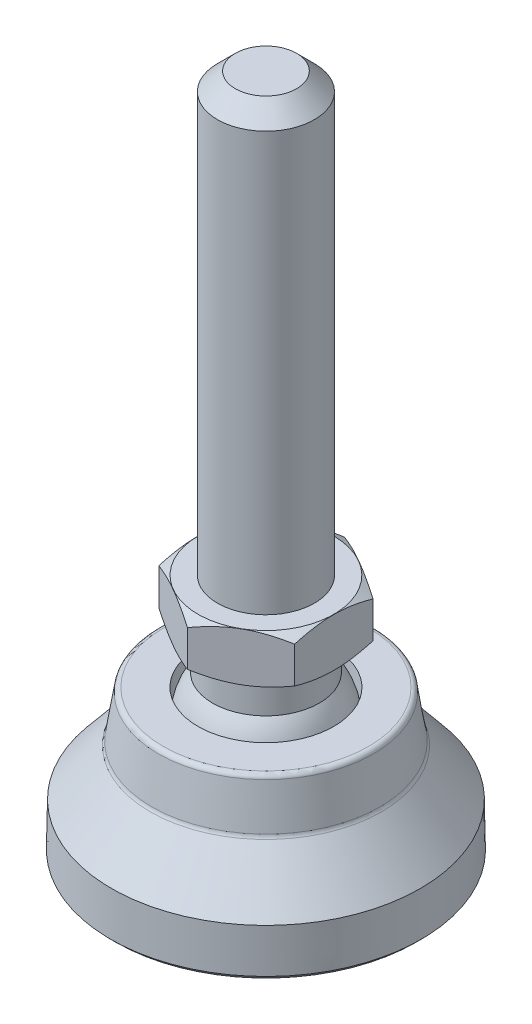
ISO-10303-21;
HEADER;
FILE_DESCRIPTION(('STEP AP214'),'2;1');
FILE_NAME('part.step','',(''),(''),'','','');
FILE_SCHEMA(('AUTOMOTIVE_DESIGN { 1 0 10303 214 1 1 1 1 }'));
ENDSEC;
DATA;
#1=APPLICATION_CONTEXT('core data for automotive mechanical design processes');
#2=APPLICATION_PROTOCOL_DEFINITION('international standard','automotive_design',2000,#1);
#3=PRODUCT_CONTEXT('',#1,'mechanical');
#4=PRODUCT('Part','Part','',(#3));
#5=PRODUCT_RELATED_PRODUCT_CATEGORY('part','',(#4));
#6=PRODUCT_DEFINITION_FORMATION('','',#4);
#7=PRODUCT_DEFINITION_CONTEXT('part definition',#1,'design');
#8=PRODUCT_DEFINITION('design','',#6,#7);
#9=PRODUCT_DEFINITION_SHAPE('','',#8);
#10=(LENGTH_UNIT() NAMED_UNIT(*) SI_UNIT(.MILLI.,.METRE.));
#11=(NAMED_UNIT(*) PLANE_ANGLE_UNIT() SI_UNIT($,.RADIAN.));
#12=(NAMED_UNIT(*) SI_UNIT($,.STERADIAN.) SOLID_ANGLE_UNIT());
#13=UNCERTAINTY_MEASURE_WITH_UNIT(LENGTH_MEASURE(1.E-05),#10,'distance_accuracy_value','');
#14=(GEOMETRIC_REPRESENTATION_CONTEXT(3) GLOBAL_UNCERTAINTY_ASSIGNED_CONTEXT((#13)) GLOBAL_UNIT_ASSIGNED_CONTEXT((#10,
#11,#12)) REPRESENTATION_CONTEXT('',''));
#15=CARTESIAN_POINT('',(0.,0.,0.));
#16=DIRECTION('',(0.,0.,1.));
#17=DIRECTION('',(1.,0.,0.));
#18=AXIS2_PLACEMENT_3D('',#15,#16,#17);
#19=CARTESIAN_POINT('',(0.,69.0800000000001,0.));
#20=DIRECTION('',(0.,-1.,0.));
#21=DIRECTION('',(1.,0.,0.));
#22=AXIS2_PLACEMENT_3D('',#19,#20,#21);
#23=CONICAL_SURFACE('',#22,4.08,0.785398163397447);
#24=CARTESIAN_POINT('',(0.,70.,0.));
#25=DIRECTION('',(0.,1.,0.));
#26=DIRECTION('',(1.,0.,0.));
#27=AXIS2_PLACEMENT_3D('',#24,#25,#26);
#28=CIRCLE('',#27,3.16);
#29=CARTESIAN_POINT('',(-3.16000000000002,70.0000000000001,0.));
#30=VERTEX_POINT('',#29);
#31=EDGE_CURVE('P0_E56',#30,#30,#28,.T.);
#32=ORIENTED_EDGE('',*,*,#31,.F.);
#33=EDGE_LOOP('',(#32));
#34=FACE_BOUND('',#33,.T.);
#35=CARTESIAN_POINT('',(0.,68.16,0.));
#36=DIRECTION('',(0.,1.,0.));
#37=DIRECTION('',(1.,0.,0.));
#38=AXIS2_PLACEMENT_3D('',#35,#36,#37);
#39=CIRCLE('',#38,5.);
#40=CARTESIAN_POINT('',(-5.00000000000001,68.16,0.));
#41=VERTEX_POINT('',#40);
#42=EDGE_CURVE('P0_E13',#41,#41,#39,.T.);
#43=ORIENTED_EDGE('',*,*,#42,.T.);
#44=EDGE_LOOP('',(#43));
#45=FACE_BOUND('',#44,.T.);
#46=ADVANCED_FACE('P0_F44',(#34,#45),#23,.T.);
#47=CARTESIAN_POINT('',(0.,45.58,0.));
#48=DIRECTION('',(0.,-1.,0.));
#49=DIRECTION('',(1.,0.,0.));
#50=AXIS2_PLACEMENT_3D('',#47,#48,#49);
#51=CYLINDRICAL_SURFACE('',#50,5.);
#52=ORIENTED_EDGE('',*,*,#42,.F.);
#53=EDGE_LOOP('',(#52));
#54=FACE_BOUND('',#53,.T.);
#55=CARTESIAN_POINT('',(0.,25.0000000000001,0.));
#56=DIRECTION('',(0.,1.,0.));
#57=DIRECTION('',(1.,0.,0.));
#58=AXIS2_PLACEMENT_3D('',#55,#56,#57);
#59=CIRCLE('',#58,5.);
#60=CARTESIAN_POINT('',(-5.,25.0000000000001,0.));
#61=VERTEX_POINT('',#60);
#62=EDGE_CURVE('P0_E52',#61,#61,#59,.T.);
#63=ORIENTED_EDGE('',*,*,#62,.T.);
#64=EDGE_LOOP('',(#63));
#65=FACE_BOUND('',#64,.T.);
#66=ADVANCED_FACE('P0_F302',(#54,#65),#51,.T.);
#67=CARTESIAN_POINT('',(0.,23.7500000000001,0.));
#68=DIRECTION('',(0.,-1.,0.));
#69=DIRECTION('',(1.,0.,0.));
#70=AXIS2_PLACEMENT_3D('',#67,#68,#69);
#71=CONICAL_SURFACE('',#70,9.1550635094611,1.0471975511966);
#72=CARTESIAN_POINT('',(0.,25.0000000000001,0.));
#73=DIRECTION('',(0.,1.,0.));
#74=DIRECTION('',(1.,0.,0.));
#75=AXIS2_PLACEMENT_3D('',#72,#73,#74);
#76=CIRCLE('',#75,6.99);
#77=CARTESIAN_POINT('',(-6.99,25.,0.));
#78=VERTEX_POINT('',#77);
#79=EDGE_CURVE('P0_E155',#78,#78,#76,.T.);
#80=ORIENTED_EDGE('',*,*,#79,.F.);
#81=EDGE_LOOP('',(#80));
#82=FACE_BOUND('',#81,.T.);
#83=CARTESIAN_POINT('',(-7.00000000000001,24.3690117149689,-4.04145188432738));
#84=CARTESIAN_POINT('',(-7.00000000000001,24.9942264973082,-1.87564434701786));
#85=CARTESIAN_POINT('',(-7.00000000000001,24.9942264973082,0.));
#86=(BOUNDED_CURVE() B_SPLINE_CURVE(2,(#83,#84,#85),.UNSPECIFIED.,.F.,
.F.) B_SPLINE_CURVE_WITH_KNOTS((3,3),(4.14125303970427,9.23939616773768),
.UNSPECIFIED.) CURVE() GEOMETRIC_REPRESENTATION_ITEM() RATIONAL_B_SPLINE_CURVE((1.21462864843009,
1.30858050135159,1.30858050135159)) REPRESENTATION_ITEM(''));
#87=CARTESIAN_POINT('',(-7.00000000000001,24.3690117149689,-4.04145188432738));
#88=VERTEX_POINT('',#87);
#89=CARTESIAN_POINT('',(-7.,24.9942264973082,0.));
#90=VERTEX_POINT('',#89);
#91=EDGE_CURVE('P0_E240',#88,#90,#86,.T.);
#92=ORIENTED_EDGE('',*,*,#91,.T.);
#93=CARTESIAN_POINT('',(-7.00000000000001,24.9942264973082,0.));
#94=CARTESIAN_POINT('',(-7.00000000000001,24.9942264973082,1.87564434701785));
#95=CARTESIAN_POINT('',(-7.00000000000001,24.3690117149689,4.04145188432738));
#96=(BOUNDED_CURVE() B_SPLINE_CURVE(2,(#93,#94,#95),.UNSPECIFIED.,.F.,
.F.) B_SPLINE_CURVE_WITH_KNOTS((3,3),(9.23939616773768,14.3375392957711),
.UNSPECIFIED.) CURVE() GEOMETRIC_REPRESENTATION_ITEM() RATIONAL_B_SPLINE_CURVE((1.30858050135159,
1.30858050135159,1.21462864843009)) REPRESENTATION_ITEM(''));
#97=CARTESIAN_POINT('',(-7.00000000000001,24.3690117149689,4.04145188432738));
#98=VERTEX_POINT('',#97);
#99=EDGE_CURVE('P0_E235',#90,#98,#96,.T.);
#100=ORIENTED_EDGE('',*,*,#99,.T.);
#101=CARTESIAN_POINT('',(-7.00000000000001,24.3690117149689,4.04145188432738));
#102=CARTESIAN_POINT('',(-3.50000000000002,25.5356783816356,6.06217782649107));
#103=CARTESIAN_POINT('',(0.,24.3690117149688,8.08290376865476));
#104=(BOUNDED_CURVE() B_SPLINE_CURVE(2,(#101,#102,#103),.UNSPECIFIED.,.F.,
.F.) B_SPLINE_CURVE_WITH_KNOTS((3,3),(4.14125303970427,14.3375392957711),
.UNSPECIFIED.) CURVE() GEOMETRIC_REPRESENTATION_ITEM() RATIONAL_B_SPLINE_CURVE((1.21462864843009,
1.40253235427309,1.21462864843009)) REPRESENTATION_ITEM(''));
#105=CARTESIAN_POINT('',(0.,24.3690117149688,8.08290376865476));
#106=VERTEX_POINT('',#105);
#107=EDGE_CURVE('P0_E185',#98,#106,#104,.T.);
#108=ORIENTED_EDGE('',*,*,#107,.T.);
#109=CARTESIAN_POINT('',(0.,24.3690117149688,8.08290376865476));
#110=CARTESIAN_POINT('',(3.5,25.5356783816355,6.06217782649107));
#111=CARTESIAN_POINT('',(7.,24.3690117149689,4.04145188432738));
#112=(BOUNDED_CURVE() B_SPLINE_CURVE(2,(#109,#110,#111),.UNSPECIFIED.,.F.,
.F.) B_SPLINE_CURVE_WITH_KNOTS((3,3),(4.14125303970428,14.3375392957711),
.UNSPECIFIED.) CURVE() GEOMETRIC_REPRESENTATION_ITEM() RATIONAL_B_SPLINE_CURVE((1.21462864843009,
1.40253235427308,1.21462864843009)) REPRESENTATION_ITEM(''));
#113=CARTESIAN_POINT('',(6.99999999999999,24.3690117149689,4.04145188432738));
#114=VERTEX_POINT('',#113);
#115=EDGE_CURVE('P0_E177',#106,#114,#112,.T.);
#116=ORIENTED_EDGE('',*,*,#115,.T.);
#117=CARTESIAN_POINT('',(7.,24.3690117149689,4.04145188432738));
#118=CARTESIAN_POINT('',(6.99999999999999,24.9942264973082,1.87564434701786));
#119=CARTESIAN_POINT('',(7.,24.9942264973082,0.));
#120=(BOUNDED_CURVE() B_SPLINE_CURVE(2,(#117,#118,#119),.UNSPECIFIED.,.F.,
.F.) B_SPLINE_CURVE_WITH_KNOTS((3,3),(4.14125303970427,9.23939616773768),
.UNSPECIFIED.) CURVE() GEOMETRIC_REPRESENTATION_ITEM() RATIONAL_B_SPLINE_CURVE((1.21462864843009,
1.30858050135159,1.30858050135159)) REPRESENTATION_ITEM(''));
#121=CARTESIAN_POINT('',(6.99999999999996,24.9942264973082,0.));
#122=VERTEX_POINT('',#121);
#123=EDGE_CURVE('P0_E186',#114,#122,#120,.T.);
#124=ORIENTED_EDGE('',*,*,#123,.T.);
#125=CARTESIAN_POINT('',(7.,24.9942264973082,0.));
#126=CARTESIAN_POINT('',(6.99999999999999,24.9942264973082,-1.87564434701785));
#127=CARTESIAN_POINT('',(7.,24.3690117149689,-4.04145188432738));
#128=(BOUNDED_CURVE() B_SPLINE_CURVE(2,(#125,#126,#127),.UNSPECIFIED.,.F.,
.F.) B_SPLINE_CURVE_WITH_KNOTS((3,3),(9.23939616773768,14.3375392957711),
.UNSPECIFIED.) CURVE() GEOMETRIC_REPRESENTATION_ITEM() RATIONAL_B_SPLINE_CURVE((1.30858050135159,
1.30858050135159,1.21462864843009)) REPRESENTATION_ITEM(''));
#129=CARTESIAN_POINT('',(6.99999999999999,24.3690117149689,-4.04145188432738));
#130=VERTEX_POINT('',#129);
#131=EDGE_CURVE('P0_E203',#122,#130,#128,.T.);
#132=ORIENTED_EDGE('',*,*,#131,.T.);
#133=CARTESIAN_POINT('',(7.,24.3690117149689,-4.04145188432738));
#134=CARTESIAN_POINT('',(3.5,25.5356783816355,-6.06217782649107));
#135=CARTESIAN_POINT('',(0.,24.3690117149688,-8.08290376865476));
#136=(BOUNDED_CURVE() B_SPLINE_CURVE(2,(#133,#134,#135),.UNSPECIFIED.,.F.,
.F.) B_SPLINE_CURVE_WITH_KNOTS((3,3),(4.14125303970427,14.3375392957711),
.UNSPECIFIED.) CURVE() GEOMETRIC_REPRESENTATION_ITEM() RATIONAL_B_SPLINE_CURVE((1.21462864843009,
1.40253235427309,1.21462864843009)) REPRESENTATION_ITEM(''));
#137=CARTESIAN_POINT('',(0.,24.3690117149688,-8.08290376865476));
#138=VERTEX_POINT('',#137);
#139=EDGE_CURVE('P0_E197',#130,#138,#136,.T.);
#140=ORIENTED_EDGE('',*,*,#139,.T.);
#141=CARTESIAN_POINT('',(0.,24.3690117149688,-8.08290376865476));
#142=CARTESIAN_POINT('',(-3.50000000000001,25.5356783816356,-6.06217782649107));
#143=CARTESIAN_POINT('',(-7.00000000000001,24.3690117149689,-4.04145188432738));
#144=(BOUNDED_CURVE() B_SPLINE_CURVE(2,(#141,#142,#143),.UNSPECIFIED.,.F.,
.F.) B_SPLINE_CURVE_WITH_KNOTS((3,3),(4.14125303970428,14.3375392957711),
.UNSPECIFIED.) CURVE() GEOMETRIC_REPRESENTATION_ITEM() RATIONAL_B_SPLINE_CURVE((1.21462864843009,
1.40253235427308,1.21462864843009)) REPRESENTATION_ITEM(''));
#145=EDGE_CURVE('P0_E146',#138,#88,#144,.T.);
#146=ORIENTED_EDGE('',*,*,#145,.T.);
#147=EDGE_LOOP('',(#92,#100,#108,#116,#124,#132,#140,#146));
#148=FACE_BOUND('',#147,.T.);
#149=ADVANCED_FACE('P0_F269',(#82,#148),#71,.T.);
#150=CARTESIAN_POINT('',(0.,21.2500000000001,0.));
#151=DIRECTION('',(0.,1.,0.));
#152=DIRECTION('',(1.,0.,0.));
#153=AXIS2_PLACEMENT_3D('',#150,#151,#152);
#154=CONICAL_SURFACE('',#153,9.1550635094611,1.0471975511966);
#155=CARTESIAN_POINT('',(-7.00000000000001,20.6309882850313,4.04145188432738));
#156=CARTESIAN_POINT('',(-6.99999999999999,20.0057735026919,1.87564434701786));
#157=CARTESIAN_POINT('',(-6.99999999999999,20.0057735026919,0.));
#158=(BOUNDED_CURVE() B_SPLINE_CURVE(2,(#155,#156,#157),.UNSPECIFIED.,.F.,
.F.) B_SPLINE_CURVE_WITH_KNOTS((3,3),(4.14125303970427,9.23939616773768),
.UNSPECIFIED.) CURVE() GEOMETRIC_REPRESENTATION_ITEM() RATIONAL_B_SPLINE_CURVE((1.21462864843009,
1.30858050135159,1.30858050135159)) REPRESENTATION_ITEM(''));
#159=CARTESIAN_POINT('',(-7.,20.6309882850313,4.04145188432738));
#160=VERTEX_POINT('',#159);
#161=CARTESIAN_POINT('',(-6.99999999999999,20.0057735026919,0.));
#162=VERTEX_POINT('',#161);
#163=EDGE_CURVE('P0_E222',#160,#162,#158,.T.);
#164=ORIENTED_EDGE('',*,*,#163,.T.);
#165=CARTESIAN_POINT('',(-6.99999999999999,20.0057735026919,0.));
#166=CARTESIAN_POINT('',(-6.99999999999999,20.0057735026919,-1.87564434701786));
#167=CARTESIAN_POINT('',(-7.00000000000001,20.6309882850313,-4.04145188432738));
#168=(BOUNDED_CURVE() B_SPLINE_CURVE(2,(#165,#166,#167),.UNSPECIFIED.,.F.,
.F.) B_SPLINE_CURVE_WITH_KNOTS((3,3),(9.23939616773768,14.3375392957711),
.UNSPECIFIED.) CURVE() GEOMETRIC_REPRESENTATION_ITEM() RATIONAL_B_SPLINE_CURVE((1.30858050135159,
1.30858050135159,1.21462864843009)) REPRESENTATION_ITEM(''));
#169=CARTESIAN_POINT('',(-7.,20.6309882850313,-4.04145188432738));
#170=VERTEX_POINT('',#169);
#171=EDGE_CURVE('P0_E140',#162,#170,#168,.T.);
#172=ORIENTED_EDGE('',*,*,#171,.T.);
#173=CARTESIAN_POINT('',(-7.00000000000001,20.6309882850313,-4.04145188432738));
#174=CARTESIAN_POINT('',(-3.5,19.4643216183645,-6.06217782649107));
#175=CARTESIAN_POINT('',(0.,20.6309882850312,-8.08290376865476));
#176=(BOUNDED_CURVE() B_SPLINE_CURVE(2,(#173,#174,#175),.UNSPECIFIED.,.F.,
.F.) B_SPLINE_CURVE_WITH_KNOTS((3,3),(4.14125303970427,14.3375392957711),
.UNSPECIFIED.) CURVE() GEOMETRIC_REPRESENTATION_ITEM() RATIONAL_B_SPLINE_CURVE((1.21462864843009,
1.40253235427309,1.21462864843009)) REPRESENTATION_ITEM(''));
#177=CARTESIAN_POINT('',(0.,20.6309882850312,-8.08290376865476));
#178=VERTEX_POINT('',#177);
#179=EDGE_CURVE('P0_E133',#170,#178,#176,.T.);
#180=ORIENTED_EDGE('',*,*,#179,.T.);
#181=CARTESIAN_POINT('',(0.,20.6309882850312,-8.08290376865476));
#182=CARTESIAN_POINT('',(3.5,19.4643216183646,-6.06217782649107));
#183=CARTESIAN_POINT('',(6.99999999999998,20.6309882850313,-4.04145188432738));
#184=(BOUNDED_CURVE() B_SPLINE_CURVE(2,(#181,#182,#183),.UNSPECIFIED.,.F.,
.F.) B_SPLINE_CURVE_WITH_KNOTS((3,3),(4.14125303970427,14.3375392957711),
.UNSPECIFIED.) CURVE() GEOMETRIC_REPRESENTATION_ITEM() RATIONAL_B_SPLINE_CURVE((1.21462864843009,
1.40253235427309,1.21462864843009)) REPRESENTATION_ITEM(''));
#185=CARTESIAN_POINT('',(6.99999999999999,20.6309882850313,-4.04145188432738));
#186=VERTEX_POINT('',#185);
#187=EDGE_CURVE('P0_E125',#178,#186,#184,.T.);
#188=ORIENTED_EDGE('',*,*,#187,.T.);
#189=CARTESIAN_POINT('',(6.99999999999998,20.6309882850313,-4.04145188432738));
#190=CARTESIAN_POINT('',(6.99999999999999,20.005773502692,-1.87564434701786));
#191=CARTESIAN_POINT('',(6.99999999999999,20.005773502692,0.));
#192=(BOUNDED_CURVE() B_SPLINE_CURVE(2,(#189,#190,#191),.UNSPECIFIED.,.F.,
.F.) B_SPLINE_CURVE_WITH_KNOTS((3,3),(4.14125303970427,9.23939616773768),
.UNSPECIFIED.) CURVE() GEOMETRIC_REPRESENTATION_ITEM() RATIONAL_B_SPLINE_CURVE((1.21462864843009,
1.30858050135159,1.30858050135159)) REPRESENTATION_ITEM(''));
#193=CARTESIAN_POINT('',(6.99999999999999,20.005773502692,0.));
#194=VERTEX_POINT('',#193);
#195=EDGE_CURVE('P0_E134',#186,#194,#192,.T.);
#196=ORIENTED_EDGE('',*,*,#195,.T.);
#197=CARTESIAN_POINT('',(6.99999999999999,20.005773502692,0.));
#198=CARTESIAN_POINT('',(6.99999999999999,20.005773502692,1.87564434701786));
#199=CARTESIAN_POINT('',(6.99999999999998,20.6309882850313,4.04145188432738));
#200=(BOUNDED_CURVE() B_SPLINE_CURVE(2,(#197,#198,#199),.UNSPECIFIED.,.F.,
.F.) B_SPLINE_CURVE_WITH_KNOTS((3,3),(9.23939616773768,14.3375392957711),
.UNSPECIFIED.) CURVE() GEOMETRIC_REPRESENTATION_ITEM() RATIONAL_B_SPLINE_CURVE((1.30858050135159,
1.30858050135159,1.21462864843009)) REPRESENTATION_ITEM(''));
#201=CARTESIAN_POINT('',(6.99999999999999,20.6309882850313,4.04145188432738));
#202=VERTEX_POINT('',#201);
#203=EDGE_CURVE('P0_E176',#194,#202,#200,.T.);
#204=ORIENTED_EDGE('',*,*,#203,.T.);
#205=CARTESIAN_POINT('',(6.99999999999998,20.6309882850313,4.04145188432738));
#206=CARTESIAN_POINT('',(3.5,19.4643216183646,6.06217782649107));
#207=CARTESIAN_POINT('',(0.,20.6309882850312,8.08290376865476));
#208=(BOUNDED_CURVE() B_SPLINE_CURVE(2,(#205,#206,#207),.UNSPECIFIED.,.F.,
.F.) B_SPLINE_CURVE_WITH_KNOTS((3,3),(4.14125303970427,14.3375392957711),
.UNSPECIFIED.) CURVE() GEOMETRIC_REPRESENTATION_ITEM() RATIONAL_B_SPLINE_CURVE((1.21462864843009,
1.40253235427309,1.21462864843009)) REPRESENTATION_ITEM(''));
#209=CARTESIAN_POINT('',(0.,20.6309882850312,8.08290376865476));
#210=VERTEX_POINT('',#209);
#211=EDGE_CURVE('P0_E161',#202,#210,#208,.T.);
#212=ORIENTED_EDGE('',*,*,#211,.T.);
#213=CARTESIAN_POINT('',(0.,20.6309882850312,8.08290376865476));
#214=CARTESIAN_POINT('',(-3.49999999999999,19.4643216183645,6.06217782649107));
#215=CARTESIAN_POINT('',(-7.00000000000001,20.6309882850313,4.04145188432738));
#216=(BOUNDED_CURVE() B_SPLINE_CURVE(2,(#213,#214,#215),.UNSPECIFIED.,.F.,
.F.) B_SPLINE_CURVE_WITH_KNOTS((3,3),(4.14125303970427,14.3375392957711),
.UNSPECIFIED.) CURVE() GEOMETRIC_REPRESENTATION_ITEM() RATIONAL_B_SPLINE_CURVE((1.21462864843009,
1.40253235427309,1.21462864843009)) REPRESENTATION_ITEM(''));
#217=EDGE_CURVE('P0_E157',#210,#160,#216,.T.);
#218=ORIENTED_EDGE('',*,*,#217,.T.);
#219=EDGE_LOOP('',(#164,#172,#180,#188,#196,#204,#212,#218));
#220=FACE_BOUND('',#219,.T.);
#221=CARTESIAN_POINT('',(0.,20.,0.));
#222=DIRECTION('',(0.,1.,0.));
#223=DIRECTION('',(1.,0.,0.));
#224=AXIS2_PLACEMENT_3D('',#221,#222,#223);
#225=CIRCLE('',#224,6.99);
#226=CARTESIAN_POINT('',(-6.99,20.0000000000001,0.));
#227=VERTEX_POINT('',#226);
#228=EDGE_CURVE('P0_E162',#227,#227,#225,.T.);
#229=ORIENTED_EDGE('',*,*,#228,.T.);
#230=EDGE_LOOP('',(#229));
#231=FACE_BOUND('',#230,.T.);
#232=ADVANCED_FACE('P0_F137',(#220,#231),#154,.T.);
#233=CARTESIAN_POINT('',(0.,18.1650635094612,0.));
#234=DIRECTION('',(0.,-1.,0.));
#235=DIRECTION('',(1.,0.,0.));
#236=AXIS2_PLACEMENT_3D('',#233,#234,#235);
#237=CYLINDRICAL_SURFACE('',#236,5.5);
#238=CARTESIAN_POINT('',(0.,20.,0.));
#239=DIRECTION('',(0.,1.,0.));
#240=DIRECTION('',(1.,0.,0.));
#241=AXIS2_PLACEMENT_3D('',#238,#239,#240);
#242=CIRCLE('',#241,5.5);
#243=CARTESIAN_POINT('',(-5.49999999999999,20.,0.));
#244=VERTEX_POINT('',#243);
#245=EDGE_CURVE('P0_E169',#244,#244,#242,.T.);
#246=ORIENTED_EDGE('',*,*,#245,.F.);
#247=EDGE_LOOP('',(#246));
#248=FACE_BOUND('',#247,.T.);
#249=CARTESIAN_POINT('',(0.,16.3301270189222,0.));
#250=DIRECTION('',(0.,1.,0.));
#251=DIRECTION('',(1.,0.,0.));
#252=AXIS2_PLACEMENT_3D('',#249,#250,#251);
#253=CIRCLE('',#252,5.5);
#254=CARTESIAN_POINT('',(-5.5,16.3301270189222,0.));
#255=VERTEX_POINT('',#254);
#256=EDGE_CURVE('P0_E192',#255,#255,#253,.T.);
#257=ORIENTED_EDGE('',*,*,#256,.T.);
#258=EDGE_LOOP('',(#257));
#259=FACE_BOUND('',#258,.T.);
#260=ADVANCED_FACE('P0_F332',(#248,#259),#237,.T.);
#261=CARTESIAN_POINT('',(0.,12.,0.));
#262=DIRECTION('',(0.,0.,1.));
#263=DIRECTION('',(1.,0.,0.));
#264=AXIS2_PLACEMENT_3D('',#261,#262,#263);
#265=SPHERICAL_SURFACE('',#264,7.);
#266=CARTESIAN_POINT('',(0.,12.,0.));
#267=DIRECTION('',(0.,1.,0.));
#268=DIRECTION('',(1.,0.,0.));
#269=AXIS2_PLACEMENT_3D('',#266,#267,#268);
#270=SPHERICAL_SURFACE('',#269,7.);
#271=ORIENTED_EDGE('',*,*,#256,.F.);
#272=EDGE_LOOP('',(#271));
#273=FACE_BOUND('',#272,.T.);
#274=ADVANCED_FACE('P0_F330',(#273),#270,.T.);
#275=CARTESIAN_POINT('',(0.,25.1000000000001,8.08290376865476));
#276=DIRECTION('',(0.5,0.,-0.866025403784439));
#277=DIRECTION('',(0.255976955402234,-0.955319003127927,0.14778836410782));
#278=AXIS2_PLACEMENT_3D('',#275,#276,#277);
#279=PLANE('',#278);
#280=ORIENTED_EDGE('',*,*,#217,.F.);
#281=DIRECTION('',(0.,-1.,0.));
#282=VECTOR('',#281,1.);
#283=CARTESIAN_POINT('',(0.,25.1000000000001,8.08290376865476));
#284=LINE('',#283,#282);
#285=EDGE_CURVE('P0_E163',#106,#210,#284,.T.);
#286=ORIENTED_EDGE('',*,*,#285,.F.);
#287=ORIENTED_EDGE('',*,*,#107,.F.);
#288=DIRECTION('',(0.,-1.,0.));
#289=VECTOR('',#288,1.);
#290=CARTESIAN_POINT('',(-6.99999999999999,25.1,4.04145188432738));
#291=LINE('',#290,#289);
#292=EDGE_CURVE('P0_E150',#98,#160,#291,.T.);
#293=ORIENTED_EDGE('',*,*,#292,.T.);
#294=EDGE_LOOP('',(#280,#286,#287,#293));
#295=FACE_BOUND('',#294,.T.);
#296=ADVANCED_FACE('P0_F274',(#295),#279,.F.);
#297=CARTESIAN_POINT('',(-6.99999999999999,25.1,4.04145188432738));
#298=DIRECTION('',(1.,0.,0.));
#299=DIRECTION('',(0.,0.,-1.));
#300=AXIS2_PLACEMENT_3D('',#297,#298,#299);
#301=PLANE('',#300);
#302=ORIENTED_EDGE('',*,*,#163,.F.);
#303=ORIENTED_EDGE('',*,*,#292,.F.);
#304=ORIENTED_EDGE('',*,*,#99,.F.);
#305=ORIENTED_EDGE('',*,*,#91,.F.);
#306=DIRECTION('',(0.,-1.,0.));
#307=VECTOR('',#306,1.);
#308=CARTESIAN_POINT('',(-6.99999999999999,25.1,-4.04145188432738));
#309=LINE('',#308,#307);
#310=EDGE_CURVE('P0_E148',#88,#170,#309,.T.);
#311=ORIENTED_EDGE('',*,*,#310,.T.);
#312=ORIENTED_EDGE('',*,*,#171,.F.);
#313=EDGE_LOOP('',(#302,#303,#304,#305,#311,#312));
#314=FACE_BOUND('',#313,.T.);
#315=ADVANCED_FACE('P0_F283',(#314),#301,.F.);
#316=CARTESIAN_POINT('',(-6.99999999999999,25.1,-4.04145188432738));
#317=DIRECTION('',(0.5,0.,0.866025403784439));
#318=DIRECTION('',(0.,-1.,0.));
#319=AXIS2_PLACEMENT_3D('',#316,#317,#318);
#320=PLANE('',#319);
#321=ORIENTED_EDGE('',*,*,#179,.F.);
#322=ORIENTED_EDGE('',*,*,#310,.F.);
#323=ORIENTED_EDGE('',*,*,#145,.F.);
#324=DIRECTION('',(0.,-1.,0.));
#325=VECTOR('',#324,1.);
#326=CARTESIAN_POINT('',(0.,25.1000000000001,-8.08290376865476));
#327=LINE('',#326,#325);
#328=EDGE_CURVE('P0_E129',#138,#178,#327,.T.);
#329=ORIENTED_EDGE('',*,*,#328,.T.);
#330=EDGE_LOOP('',(#321,#322,#323,#329));
#331=FACE_BOUND('',#330,.T.);
#332=ADVANCED_FACE('P0_F145',(#331),#320,.F.);
#333=CARTESIAN_POINT('',(0.,25.1000000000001,-8.08290376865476));
#334=DIRECTION('',(-0.5,0.,0.866025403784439));
#335=DIRECTION('',(0.,1.,0.));
#336=AXIS2_PLACEMENT_3D('',#333,#334,#335);
#337=PLANE('',#336);
#338=ORIENTED_EDGE('',*,*,#187,.F.);
#339=ORIENTED_EDGE('',*,*,#328,.F.);
#340=ORIENTED_EDGE('',*,*,#139,.F.);
#341=DIRECTION('',(0.,-1.,0.));
#342=VECTOR('',#341,1.);
#343=CARTESIAN_POINT('',(7.00000000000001,25.1,-4.04145188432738));
#344=LINE('',#343,#342);
#345=EDGE_CURVE('P0_E131',#130,#186,#344,.T.);
#346=ORIENTED_EDGE('',*,*,#345,.T.);
#347=EDGE_LOOP('',(#338,#339,#340,#346));
#348=FACE_BOUND('',#347,.T.);
#349=ADVANCED_FACE('P0_F127',(#348),#337,.F.);
#350=CARTESIAN_POINT('',(7.00000000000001,25.1,-4.04145188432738));
#351=DIRECTION('',(-1.,0.,0.));
#352=DIRECTION('',(0.,0.,1.));
#353=AXIS2_PLACEMENT_3D('',#350,#351,#352);
#354=PLANE('',#353);
#355=ORIENTED_EDGE('',*,*,#195,.F.);
#356=ORIENTED_EDGE('',*,*,#345,.F.);
#357=ORIENTED_EDGE('',*,*,#131,.F.);
#358=ORIENTED_EDGE('',*,*,#123,.F.);
#359=DIRECTION('',(0.,-1.,0.));
#360=VECTOR('',#359,1.);
#361=CARTESIAN_POINT('',(7.00000000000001,25.1,4.04145188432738));
#362=LINE('',#361,#360);
#363=EDGE_CURVE('P0_E152',#114,#202,#362,.T.);
#364=ORIENTED_EDGE('',*,*,#363,.T.);
#365=ORIENTED_EDGE('',*,*,#203,.F.);
#366=EDGE_LOOP('',(#355,#356,#357,#358,#364,#365));
#367=FACE_BOUND('',#366,.T.);
#368=ADVANCED_FACE('P0_F279',(#367),#354,.F.);
#369=CARTESIAN_POINT('',(7.00000000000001,25.1,4.04145188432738));
#370=DIRECTION('',(-0.5,0.,-0.866025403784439));
#371=DIRECTION('',(-0.843610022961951,-0.226044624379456,0.487058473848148));
#372=AXIS2_PLACEMENT_3D('',#369,#370,#371);
#373=PLANE('',#372);
#374=ORIENTED_EDGE('',*,*,#211,.F.);
#375=ORIENTED_EDGE('',*,*,#363,.F.);
#376=ORIENTED_EDGE('',*,*,#115,.F.);
#377=ORIENTED_EDGE('',*,*,#285,.T.);
#378=EDGE_LOOP('',(#374,#375,#376,#377));
#379=FACE_BOUND('',#378,.T.);
#380=ADVANCED_FACE('P0_F276',(#379),#373,.F.);
#381=CARTESIAN_POINT('',(6.24500000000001,20.0000000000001,0.));
#382=DIRECTION('',(0.,-1.,0.));
#383=DIRECTION('',(-1.,0.,0.));
#384=AXIS2_PLACEMENT_3D('',#381,#382,#383);
#385=PLANE('',#384);
#386=ORIENTED_EDGE('',*,*,#228,.F.);
#387=EDGE_LOOP('',(#386));
#388=FACE_BOUND('',#387,.T.);
#389=ORIENTED_EDGE('',*,*,#245,.T.);
#390=EDGE_LOOP('',(#389));
#391=FACE_BOUND('',#390,.T.);
#392=ADVANCED_FACE('P0_F307',(#388,#391),#385,.T.);
#393=CARTESIAN_POINT('',(5.99499999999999,25.0000000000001,0.));
#394=DIRECTION('',(0.,1.,0.));
#395=DIRECTION('',(0.,0.,-1.));
#396=AXIS2_PLACEMENT_3D('',#393,#394,#395);
#397=PLANE('',#396);
#398=ORIENTED_EDGE('',*,*,#79,.T.);
#399=EDGE_LOOP('',(#398));
#400=FACE_BOUND('',#399,.T.);
#401=ORIENTED_EDGE('',*,*,#62,.F.);
#402=EDGE_LOOP('',(#401));
#403=FACE_BOUND('',#402,.T.);
#404=ADVANCED_FACE('P0_F304',(#400,#403),#397,.T.);
#405=CARTESIAN_POINT('',(1.58000000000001,70.,0.));
#406=DIRECTION('',(0.,1.,0.));
#407=DIRECTION('',(0.,0.,-1.));
#408=AXIS2_PLACEMENT_3D('',#405,#406,#407);
#409=PLANE('',#408);
#410=ORIENTED_EDGE('',*,*,#31,.T.);
#411=EDGE_LOOP('',(#410));
#412=FACE_BOUND('',#411,.T.);
#413=ADVANCED_FACE('P0_F306',(#412),#409,.T.);
#414=CLOSED_SHELL('',(#46,#66,#149,#232,#260,#274,#296,#315,#332,#349,#368,#380,#392,#404,#413));
#415=MANIFOLD_SOLID_BREP('P0_B2',#414);
#416=CARTESIAN_POINT('',(0.,14.5,0.));
#417=DIRECTION('',(0.,1.,0.));
#418=DIRECTION('',(0.,0.,1.));
#419=AXIS2_PLACEMENT_3D('',#416,#417,#418);
#420=TOROIDAL_SURFACE('',#419,10.5729596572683,0.5);
#421=CARTESIAN_POINT('',(0.,15.,0.));
#422=DIRECTION('',(0.,1.,0.));
#423=DIRECTION('',(1.,0.,0.));
#424=AXIS2_PLACEMENT_3D('',#421,#422,#423);
#425=CIRCLE('',#424,10.5729596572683);
#426=CARTESIAN_POINT('',(0.,15.,-10.5729596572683));
#427=VERTEX_POINT('',#426);
#428=EDGE_CURVE('P1_E39',#427,#427,#425,.T.);
#429=ORIENTED_EDGE('',*,*,#428,.F.);
#430=EDGE_LOOP('',(#429));
#431=FACE_BOUND('',#430,.T.);
#432=CARTESIAN_POINT('',(0.,14.5782172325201,0.));
#433=DIRECTION('',(0.,1.,0.));
#434=DIRECTION('',(1.,0.,0.));
#435=AXIS2_PLACEMENT_3D('',#432,#433,#434);
#436=CIRCLE('',#435,11.0668038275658);
#437=CARTESIAN_POINT('',(-11.0668038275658,14.5782172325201,0.));
#438=VERTEX_POINT('',#437);
#439=EDGE_CURVE('P1_E11',#438,#438,#436,.T.);
#440=ORIENTED_EDGE('',*,*,#439,.T.);
#441=EDGE_LOOP('',(#440));
#442=FACE_BOUND('',#441,.T.);
#443=ADVANCED_FACE('P1_F16',(#431,#442),#420,.T.);
#444=CARTESIAN_POINT('',(0.,12.3902724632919,0.));
#445=DIRECTION('',(0.,-1.,0.));
#446=DIRECTION('',(1.,0.,0.));
#447=AXIS2_PLACEMENT_3D('',#444,#445,#446);
#448=CONICAL_SURFACE('',#447,11.413340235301,0.15707963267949);
#449=ORIENTED_EDGE('',*,*,#439,.F.);
#450=EDGE_LOOP('',(#449));
#451=FACE_BOUND('',#450,.T.);
#452=CARTESIAN_POINT('',(0.,10.2023276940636,0.));
#453=DIRECTION('',(0.,1.,0.));
#454=DIRECTION('',(1.,0.,0.));
#455=AXIS2_PLACEMENT_3D('',#452,#453,#454);
#456=CIRCLE('',#455,11.7598766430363);
#457=CARTESIAN_POINT('',(0.,10.2023276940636,11.7598766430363));
#458=VERTEX_POINT('',#457);
#459=EDGE_CURVE('P1_E27',#458,#458,#456,.T.);
#460=ORIENTED_EDGE('',*,*,#459,.T.);
#461=EDGE_LOOP('',(#460));
#462=FACE_BOUND('',#461,.T.);
#463=ADVANCED_FACE('P1_F125',(#451,#462),#448,.T.);
#464=CARTESIAN_POINT('',(0.,10.3196535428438,0.));
#465=DIRECTION('',(0.,1.,0.));
#466=DIRECTION('',(0.,0.,1.));
#467=AXIS2_PLACEMENT_3D('',#464,#465,#466);
#468=TOROIDAL_SURFACE('',#467,12.5006428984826,0.749999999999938);
#469=ORIENTED_EDGE('',*,*,#459,.F.);
#470=EDGE_LOOP('',(#469));
#471=FACE_BOUND('',#470,.T.);
#472=CARTESIAN_POINT('',(0.,9.84205465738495,0.));
#473=DIRECTION('',(0.,1.,0.));
#474=DIRECTION('',(1.,0.,0.));
#475=AXIS2_PLACEMENT_3D('',#472,#473,#474);
#476=CIRCLE('',#475,11.9223702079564);
#477=CARTESIAN_POINT('',(11.9223702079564,9.84205465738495,0.));
#478=VERTEX_POINT('',#477);
#479=EDGE_CURVE('P1_E74',#478,#478,#476,.T.);
#480=ORIENTED_EDGE('',*,*,#479,.T.);
#481=EDGE_LOOP('',(#480));
#482=FACE_BOUND('',#481,.T.);
#483=ADVANCED_FACE('P1_F130',(#471,#482),#468,.F.);
#484=CARTESIAN_POINT('',(0.,7.42102732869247,0.));
#485=DIRECTION('',(0.,-1.,0.));
#486=DIRECTION('',(1.,0.,0.));
#487=AXIS2_PLACEMENT_3D('',#484,#485,#486);
#488=CONICAL_SURFACE('',#487,13.9219112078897,0.690338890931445);
#489=ORIENTED_EDGE('',*,*,#479,.F.);
#490=EDGE_LOOP('',(#489));
#491=FACE_BOUND('',#490,.T.);
#492=CARTESIAN_POINT('',(0.,5.,0.));
#493=DIRECTION('',(0.,1.,0.));
#494=DIRECTION('',(1.,0.,0.));
#495=AXIS2_PLACEMENT_3D('',#492,#493,#494);
#496=CIRCLE('',#495,15.921452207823);
#497=CARTESIAN_POINT('',(-15.921452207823,5.,0.));
#498=VERTEX_POINT('',#497);
#499=EDGE_CURVE('P1_E66',#498,#498,#496,.T.);
#500=ORIENTED_EDGE('',*,*,#499,.T.);
#501=EDGE_LOOP('',(#500));
#502=FACE_BOUND('',#501,.T.);
#503=ADVANCED_FACE('P1_F136',(#491,#502),#488,.T.);
#504=CARTESIAN_POINT('',(0.,2.75,0.));
#505=DIRECTION('',(0.,-1.,0.));
#506=DIRECTION('',(1.,0.,0.));
#507=AXIS2_PLACEMENT_3D('',#504,#505,#506);
#508=CONICAL_SURFACE('',#507,15.9607261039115,0.0174532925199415);
#509=ORIENTED_EDGE('',*,*,#499,.F.);
#510=EDGE_LOOP('',(#509));
#511=FACE_BOUND('',#510,.T.);
#512=CARTESIAN_POINT('',(0.,0.5,0.));
#513=DIRECTION('',(0.,1.,0.));
#514=DIRECTION('',(1.,0.,0.));
#515=AXIS2_PLACEMENT_3D('',#512,#513,#514);
#516=CIRCLE('',#515,16.);
#517=CARTESIAN_POINT('',(-16.,0.5,0.));
#518=VERTEX_POINT('',#517);
#519=EDGE_CURVE('P1_E97',#518,#518,#516,.T.);
#520=ORIENTED_EDGE('',*,*,#519,.T.);
#521=EDGE_LOOP('',(#520));
#522=FACE_BOUND('',#521,.T.);
#523=ADVANCED_FACE('P1_F121',(#511,#522),#508,.T.);
#524=CARTESIAN_POINT('',(0.,0.25,0.));
#525=DIRECTION('',(0.,1.,0.));
#526=DIRECTION('',(1.,0.,0.));
#527=AXIS2_PLACEMENT_3D('',#524,#525,#526);
#528=CONICAL_SURFACE('',#527,15.75,0.785398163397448);
#529=ORIENTED_EDGE('',*,*,#519,.F.);
#530=EDGE_LOOP('',(#529));
#531=FACE_BOUND('',#530,.T.);
#532=CARTESIAN_POINT('',(0.,0.,0.));
#533=DIRECTION('',(0.,1.,0.));
#534=DIRECTION('',(1.,0.,0.));
#535=AXIS2_PLACEMENT_3D('',#532,#533,#534);
#536=CIRCLE('',#535,15.5);
#537=CARTESIAN_POINT('',(-15.5,0.,0.));
#538=VERTEX_POINT('',#537);
#539=EDGE_CURVE('P1_E79',#538,#538,#536,.T.);
#540=ORIENTED_EDGE('',*,*,#539,.T.);
#541=EDGE_LOOP('',(#540));
#542=FACE_BOUND('',#541,.T.);
#543=ADVANCED_FACE('P1_F113',(#531,#542),#528,.T.);
#544=CARTESIAN_POINT('',(0.,19.5,0.));
#545=DIRECTION('',(0.,-1.,0.));
#546=DIRECTION('',(1.,0.,0.));
#547=AXIS2_PLACEMENT_3D('',#544,#545,#546);
#548=CYLINDRICAL_SURFACE('',#547,7.);
#549=CARTESIAN_POINT('',(0.,12.,0.));
#550=DIRECTION('',(0.,1.,0.));
#551=DIRECTION('',(1.,0.,0.));
#552=AXIS2_PLACEMENT_3D('',#549,#550,#551);
#553=CIRCLE('',#552,7.);
#554=CARTESIAN_POINT('',(0.,12.,-7.));
#555=VERTEX_POINT('',#554);
#556=CARTESIAN_POINT('',(0.,12.,7.));
#557=VERTEX_POINT('',#556);
#558=EDGE_CURVE('P1_E84',#555,#557,#553,.T.);
#559=ORIENTED_EDGE('',*,*,#558,.F.);
#560=CARTESIAN_POINT('',(0.,12.,0.));
#561=DIRECTION('',(0.,1.,0.));
#562=DIRECTION('',(1.,0.,0.));
#563=AXIS2_PLACEMENT_3D('',#560,#561,#562);
#564=CIRCLE('',#563,7.);
#565=EDGE_CURVE('P1_E87',#557,#555,#564,.T.);
#566=ORIENTED_EDGE('',*,*,#565,.F.);
#567=EDGE_LOOP('',(#559,#566));
#568=FACE_BOUND('',#567,.T.);
#569=CARTESIAN_POINT('',(0.,15.,0.));
#570=DIRECTION('',(0.,-1.,0.));
#571=DIRECTION('',(1.,0.,0.));
#572=AXIS2_PLACEMENT_3D('',#569,#570,#571);
#573=CIRCLE('',#572,7.);
#574=CARTESIAN_POINT('',(-7.,15.,0.));
#575=VERTEX_POINT('',#574);
#576=EDGE_CURVE('P1_E20',#575,#575,#573,.T.);
#577=ORIENTED_EDGE('',*,*,#576,.F.);
#578=EDGE_LOOP('',(#577));
#579=FACE_BOUND('',#578,.T.);
#580=ADVANCED_FACE('P1_F18',(#568,#579),#548,.F.);
#581=CARTESIAN_POINT('',(0.,12.,0.));
#582=DIRECTION('',(0.,0.,1.));
#583=DIRECTION('',(1.,0.,0.));
#584=AXIS2_PLACEMENT_3D('',#581,#582,#583);
#585=SPHERICAL_SURFACE('',#584,7.);
#586=CARTESIAN_POINT('',(0.,12.,0.));
#587=DIRECTION('',(0.,1.,0.));
#588=DIRECTION('',(1.,0.,0.));
#589=AXIS2_PLACEMENT_3D('',#586,#587,#588);
#590=SPHERICAL_SURFACE('',#589,7.);
#591=ORIENTED_EDGE('',*,*,#565,.T.);
#592=ORIENTED_EDGE('',*,*,#558,.T.);
#593=EDGE_LOOP('',(#591,#592));
#594=FACE_BOUND('',#593,.T.);
#595=ADVANCED_FACE('P1_F91',(#594),#590,.F.);
#596=CARTESIAN_POINT('',(7.75,0.,0.));
#597=DIRECTION('',(0.,-1.,0.));
#598=DIRECTION('',(0.,0.,-1.));
#599=AXIS2_PLACEMENT_3D('',#596,#597,#598);
#600=PLANE('',#599);
#601=ORIENTED_EDGE('',*,*,#539,.F.);
#602=EDGE_LOOP('',(#601));
#603=FACE_BOUND('',#602,.T.);
#604=ADVANCED_FACE('P1_F119',(#603),#600,.T.);
#605=CARTESIAN_POINT('',(5.28647982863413,15.,0.));
#606=DIRECTION('',(0.,1.,0.));
#607=DIRECTION('',(1.,0.,0.));
#608=AXIS2_PLACEMENT_3D('',#605,#606,#607);
#609=PLANE('',#608);
#610=ORIENTED_EDGE('',*,*,#428,.T.);
#611=EDGE_LOOP('',(#610));
#612=FACE_BOUND('',#611,.T.);
#613=ORIENTED_EDGE('',*,*,#576,.T.);
#614=EDGE_LOOP('',(#613));
#615=FACE_BOUND('',#614,.T.);
#616=ADVANCED_FACE('P1_F111',(#612,#615),#609,.T.);
#617=CLOSED_SHELL('',(#443,#463,#483,#503,#523,#543,#580,#595,#604,#616));
#618=MANIFOLD_SOLID_BREP('P1_B1',#617);
#619=ADVANCED_BREP_SHAPE_REPRESENTATION('',(#18,#415,#618),#14);
#620=SHAPE_DEFINITION_REPRESENTATION(#9,#619);
ENDSEC;
END-ISO-10303-21;
